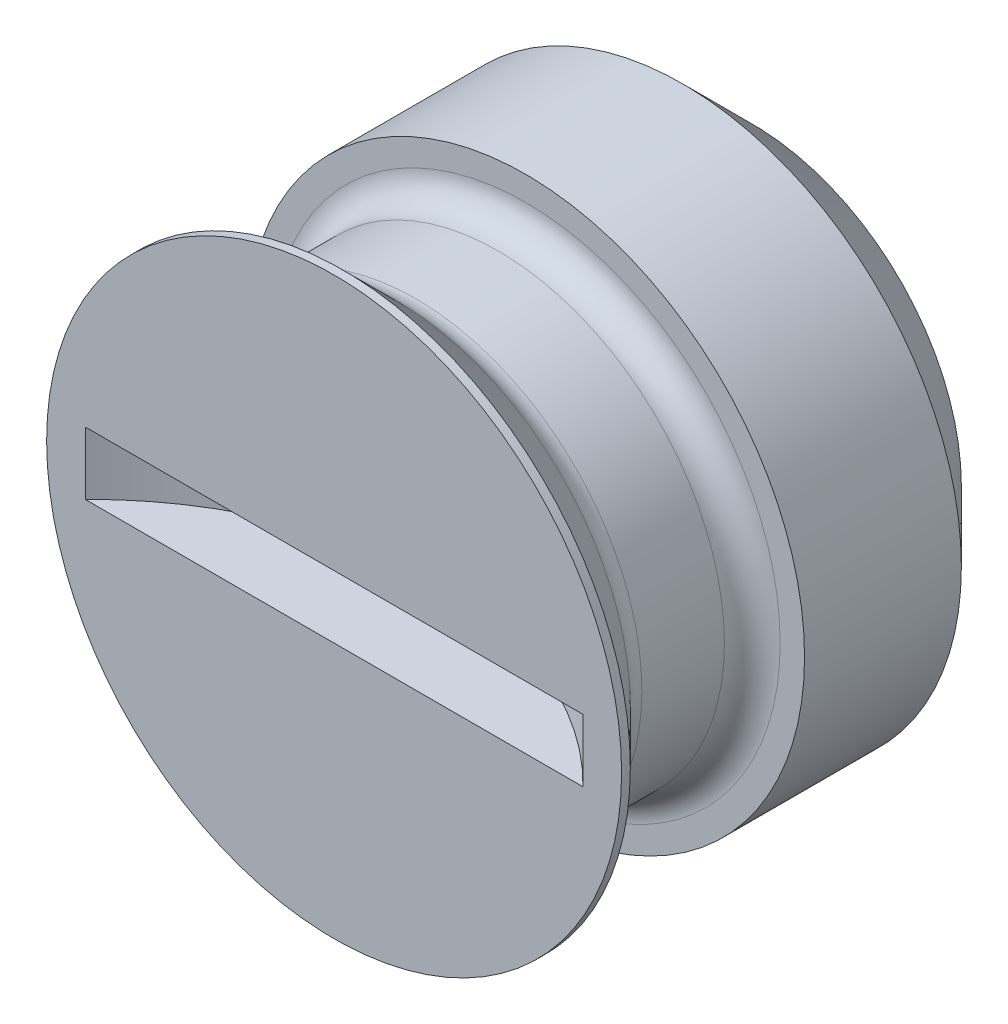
ISO-10303-21;
HEADER;
FILE_DESCRIPTION(('STEP AP214'),'2;1');
FILE_NAME('part.step','',(''),(''),'','','');
FILE_SCHEMA(('AUTOMOTIVE_DESIGN { 1 0 10303 214 1 1 1 1 }'));
ENDSEC;
DATA;
#1=APPLICATION_CONTEXT('core data for automotive mechanical design processes');
#2=APPLICATION_PROTOCOL_DEFINITION('international standard','automotive_design',2000,#1);
#3=PRODUCT_CONTEXT('',#1,'mechanical');
#4=PRODUCT('Part','Part','',(#3));
#5=PRODUCT_RELATED_PRODUCT_CATEGORY('part','',(#4));
#6=PRODUCT_DEFINITION_FORMATION('','',#4);
#7=PRODUCT_DEFINITION_CONTEXT('part definition',#1,'design');
#8=PRODUCT_DEFINITION('design','',#6,#7);
#9=PRODUCT_DEFINITION_SHAPE('','',#8);
#10=(LENGTH_UNIT() NAMED_UNIT(*) SI_UNIT(.MILLI.,.METRE.));
#11=(NAMED_UNIT(*) PLANE_ANGLE_UNIT() SI_UNIT($,.RADIAN.));
#12=(NAMED_UNIT(*) SI_UNIT($,.STERADIAN.) SOLID_ANGLE_UNIT());
#13=UNCERTAINTY_MEASURE_WITH_UNIT(LENGTH_MEASURE(1.E-05),#10,'distance_accuracy_value','');
#14=(GEOMETRIC_REPRESENTATION_CONTEXT(3) GLOBAL_UNCERTAINTY_ASSIGNED_CONTEXT((#13)) GLOBAL_UNIT_ASSIGNED_CONTEXT((#10,
#11,#12)) REPRESENTATION_CONTEXT('',''));
#15=CARTESIAN_POINT('',(0.,0.,0.));
#16=DIRECTION('',(0.,0.,1.));
#17=DIRECTION('',(1.,0.,0.));
#18=AXIS2_PLACEMENT_3D('',#15,#16,#17);
#19=CARTESIAN_POINT('',(0.,8.25,0.));
#20=DIRECTION('',(0.,0.,-1.));
#21=DIRECTION('',(-1.,0.,0.));
#22=AXIS2_PLACEMENT_3D('',#19,#20,#21);
#23=PLANE('',#22);
#24=CARTESIAN_POINT('',(0.,0.,0.));
#25=DIRECTION('',(0.,0.,1.));
#26=DIRECTION('',(1.,0.,0.));
#27=AXIS2_PLACEMENT_3D('',#24,#25,#26);
#28=CIRCLE('',#27,8.25);
#29=CARTESIAN_POINT('',(8.25,0.,0.));
#30=VERTEX_POINT('',#29);
#31=EDGE_CURVE('E76',#30,#30,#28,.T.);
#32=ORIENTED_EDGE('',*,*,#31,.T.);
#33=EDGE_LOOP('',(#32));
#34=FACE_BOUND('',#33,.T.);
#35=DIRECTION('',(1.,0.,0.));
#36=VECTOR('',#35,1.);
#37=CARTESIAN_POINT('',(0.,-0.9,0.));
#38=LINE('',#37,#36);
#39=CARTESIAN_POINT('',(-7.14142842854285,-0.9,0.));
#40=VERTEX_POINT('',#39);
#41=CARTESIAN_POINT('',(7.14142842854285,-0.9,0.));
#42=VERTEX_POINT('',#41);
#43=EDGE_CURVE('E9',#40,#42,#38,.T.);
#44=ORIENTED_EDGE('',*,*,#43,.F.);
#45=DIRECTION('',(0.,1.,0.));
#46=VECTOR('',#45,1.);
#47=CARTESIAN_POINT('',(-7.14142842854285,-0.9,0.));
#48=LINE('',#47,#46);
#49=CARTESIAN_POINT('',(-7.14142842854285,0.9,0.));
#50=VERTEX_POINT('',#49);
#51=EDGE_CURVE('E22',#40,#50,#48,.T.);
#52=ORIENTED_EDGE('',*,*,#51,.T.);
#53=DIRECTION('',(1.,0.,0.));
#54=VECTOR('',#53,1.);
#55=CARTESIAN_POINT('',(0.,0.9,0.));
#56=LINE('',#55,#54);
#57=CARTESIAN_POINT('',(7.14142842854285,0.9,0.));
#58=VERTEX_POINT('',#57);
#59=EDGE_CURVE('E40',#50,#58,#56,.T.);
#60=ORIENTED_EDGE('',*,*,#59,.T.);
#61=DIRECTION('',(0.,1.,0.));
#62=VECTOR('',#61,1.);
#63=CARTESIAN_POINT('',(7.14142842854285,-0.9,0.));
#64=LINE('',#63,#62);
#65=EDGE_CURVE('E44',#58,#42,#64,.F.);
#66=ORIENTED_EDGE('',*,*,#65,.T.);
#67=EDGE_LOOP('',(#44,#52,#60,#66));
#68=FACE_BOUND('',#67,.T.);
#69=ADVANCED_FACE('F14',(#34,#68),#23,.F.);
#70=CARTESIAN_POINT('',(0.,6.,-12.));
#71=DIRECTION('',(0.,0.,1.));
#72=DIRECTION('',(1.,0.,0.));
#73=AXIS2_PLACEMENT_3D('',#70,#71,#72);
#74=PLANE('',#73);
#75=CARTESIAN_POINT('',(0.,0.,-12.));
#76=DIRECTION('',(0.,0.,1.));
#77=DIRECTION('',(1.,0.,0.));
#78=AXIS2_PLACEMENT_3D('',#75,#76,#77);
#79=CIRCLE('',#78,6.);
#80=CARTESIAN_POINT('',(6.,0.,-12.));
#81=VERTEX_POINT('',#80);
#82=EDGE_CURVE('E45',#81,#81,#79,.T.);
#83=ORIENTED_EDGE('',*,*,#82,.F.);
#84=EDGE_LOOP('',(#83));
#85=FACE_BOUND('',#84,.T.);
#86=ADVANCED_FACE('F16',(#85),#74,.F.);
#87=CARTESIAN_POINT('',(0.,0.,-12.));
#88=DIRECTION('',(0.,0.,1.));
#89=DIRECTION('',(1.,0.,0.));
#90=AXIS2_PLACEMENT_3D('',#87,#88,#89);
#91=CONICAL_SURFACE('',#90,6.,0.785398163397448);
#92=CARTESIAN_POINT('',(0.,0.,-10.));
#93=DIRECTION('',(0.,0.,1.));
#94=DIRECTION('',(1.,0.,0.));
#95=AXIS2_PLACEMENT_3D('',#92,#93,#94);
#96=CIRCLE('',#95,8.);
#97=CARTESIAN_POINT('',(8.,0.,-10.));
#98=VERTEX_POINT('',#97);
#99=EDGE_CURVE('E55',#98,#98,#96,.T.);
#100=ORIENTED_EDGE('',*,*,#99,.F.);
#101=EDGE_LOOP('',(#100));
#102=FACE_BOUND('',#101,.T.);
#103=ORIENTED_EDGE('',*,*,#82,.T.);
#104=EDGE_LOOP('',(#103));
#105=FACE_BOUND('',#104,.T.);
#106=ADVANCED_FACE('F99',(#102,#105),#91,.T.);
#107=CARTESIAN_POINT('',(0.,0.,0.));
#108=DIRECTION('',(0.,0.,1.));
#109=DIRECTION('',(1.,0.,0.));
#110=AXIS2_PLACEMENT_3D('',#107,#108,#109);
#111=CYLINDRICAL_SURFACE('',#110,8.);
#112=CARTESIAN_POINT('',(0.,0.,-5.5));
#113=DIRECTION('',(0.,0.,1.));
#114=DIRECTION('',(1.,0.,0.));
#115=AXIS2_PLACEMENT_3D('',#112,#113,#114);
#116=CIRCLE('',#115,8.);
#117=CARTESIAN_POINT('',(8.,0.,-5.5));
#118=VERTEX_POINT('',#117);
#119=EDGE_CURVE('E58',#118,#118,#116,.T.);
#120=ORIENTED_EDGE('',*,*,#119,.F.);
#121=EDGE_LOOP('',(#120));
#122=FACE_BOUND('',#121,.T.);
#123=ORIENTED_EDGE('',*,*,#99,.T.);
#124=EDGE_LOOP('',(#123));
#125=FACE_BOUND('',#124,.T.);
#126=ADVANCED_FACE('F124',(#122,#125),#111,.T.);
#127=CARTESIAN_POINT('',(0.,8.,-5.5));
#128=DIRECTION('',(0.,0.,-1.));
#129=DIRECTION('',(-1.,0.,0.));
#130=AXIS2_PLACEMENT_3D('',#127,#128,#129);
#131=PLANE('',#130);
#132=CARTESIAN_POINT('',(0.,0.,-5.5));
#133=DIRECTION('',(0.,0.,1.));
#134=DIRECTION('',(1.,0.,0.));
#135=AXIS2_PLACEMENT_3D('',#132,#133,#134);
#136=CIRCLE('',#135,7.3);
#137=CARTESIAN_POINT('',(7.3,0.,-5.5));
#138=VERTEX_POINT('',#137);
#139=EDGE_CURVE('E61',#138,#138,#136,.T.);
#140=ORIENTED_EDGE('',*,*,#139,.F.);
#141=EDGE_LOOP('',(#140));
#142=FACE_BOUND('',#141,.T.);
#143=ORIENTED_EDGE('',*,*,#119,.T.);
#144=EDGE_LOOP('',(#143));
#145=FACE_BOUND('',#144,.T.);
#146=ADVANCED_FACE('F120',(#142,#145),#131,.F.);
#147=CARTESIAN_POINT('',(0.,0.,-4.7));
#148=DIRECTION('',(0.,0.,1.));
#149=DIRECTION('',(1.,0.,0.));
#150=AXIS2_PLACEMENT_3D('',#147,#148,#149);
#151=TOROIDAL_SURFACE('',#150,7.3,0.8);
#152=CARTESIAN_POINT('',(0.,0.,-4.7));
#153=DIRECTION('',(0.,0.,1.));
#154=DIRECTION('',(1.,0.,0.));
#155=AXIS2_PLACEMENT_3D('',#152,#153,#154);
#156=CIRCLE('',#155,6.5);
#157=CARTESIAN_POINT('',(6.5,0.,-4.7));
#158=VERTEX_POINT('',#157);
#159=EDGE_CURVE('E64',#158,#158,#156,.T.);
#160=ORIENTED_EDGE('',*,*,#159,.F.);
#161=EDGE_LOOP('',(#160));
#162=FACE_BOUND('',#161,.T.);
#163=ORIENTED_EDGE('',*,*,#139,.T.);
#164=EDGE_LOOP('',(#163));
#165=FACE_BOUND('',#164,.T.);
#166=ADVANCED_FACE('F116',(#162,#165),#151,.F.);
#167=CARTESIAN_POINT('',(0.,0.,0.));
#168=DIRECTION('',(0.,0.,1.));
#169=DIRECTION('',(1.,0.,0.));
#170=AXIS2_PLACEMENT_3D('',#167,#168,#169);
#171=CYLINDRICAL_SURFACE('',#170,6.5);
#172=CARTESIAN_POINT('',(0.,0.,-2.33137084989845));
#173=DIRECTION('',(0.,0.,1.));
#174=DIRECTION('',(1.,0.,0.));
#175=AXIS2_PLACEMENT_3D('',#172,#173,#174);
#176=CIRCLE('',#175,6.5);
#177=CARTESIAN_POINT('',(6.5,0.,-2.33137084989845));
#178=VERTEX_POINT('',#177);
#179=EDGE_CURVE('E67',#178,#178,#176,.T.);
#180=ORIENTED_EDGE('',*,*,#179,.F.);
#181=EDGE_LOOP('',(#180));
#182=FACE_BOUND('',#181,.T.);
#183=ORIENTED_EDGE('',*,*,#159,.T.);
#184=EDGE_LOOP('',(#183));
#185=FACE_BOUND('',#184,.T.);
#186=ADVANCED_FACE('F112',(#182,#185),#171,.T.);
#187=CARTESIAN_POINT('',(0.,0.,-2.33137084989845));
#188=DIRECTION('',(0.,0.,1.));
#189=DIRECTION('',(1.,0.,0.));
#190=AXIS2_PLACEMENT_3D('',#187,#188,#189);
#191=TOROIDAL_SURFACE('',#190,7.3,0.80000000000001);
#192=CARTESIAN_POINT('',(0.,0.,-1.7656854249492));
#193=DIRECTION('',(0.,0.,1.));
#194=DIRECTION('',(1.,0.,0.));
#195=AXIS2_PLACEMENT_3D('',#192,#193,#194);
#196=CIRCLE('',#195,6.73431457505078);
#197=CARTESIAN_POINT('',(6.73431457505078,0.,-1.7656854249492));
#198=VERTEX_POINT('',#197);
#199=EDGE_CURVE('E70',#198,#198,#196,.T.);
#200=ORIENTED_EDGE('',*,*,#199,.F.);
#201=EDGE_LOOP('',(#200));
#202=FACE_BOUND('',#201,.T.);
#203=ORIENTED_EDGE('',*,*,#179,.T.);
#204=EDGE_LOOP('',(#203));
#205=FACE_BOUND('',#204,.T.);
#206=ADVANCED_FACE('F108',(#202,#205),#191,.F.);
#207=CARTESIAN_POINT('',(0.,0.,-1.7656854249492));
#208=DIRECTION('',(0.,0.,1.));
#209=DIRECTION('',(1.,0.,0.));
#210=AXIS2_PLACEMENT_3D('',#207,#208,#209);
#211=CONICAL_SURFACE('',#210,6.73431457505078,0.785398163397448);
#212=CARTESIAN_POINT('',(0.,0.,-0.249999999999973));
#213=DIRECTION('',(0.,0.,1.));
#214=DIRECTION('',(1.,0.,0.));
#215=AXIS2_PLACEMENT_3D('',#212,#213,#214);
#216=CIRCLE('',#215,8.25);
#217=CARTESIAN_POINT('',(8.25,0.,-0.249999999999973));
#218=VERTEX_POINT('',#217);
#219=EDGE_CURVE('E73',#218,#218,#216,.T.);
#220=ORIENTED_EDGE('',*,*,#219,.F.);
#221=EDGE_LOOP('',(#220));
#222=FACE_BOUND('',#221,.T.);
#223=ORIENTED_EDGE('',*,*,#199,.T.);
#224=EDGE_LOOP('',(#223));
#225=FACE_BOUND('',#224,.T.);
#226=ADVANCED_FACE('F104',(#222,#225),#211,.T.);
#227=CARTESIAN_POINT('',(0.,0.,0.));
#228=DIRECTION('',(0.,0.,1.));
#229=DIRECTION('',(1.,0.,0.));
#230=AXIS2_PLACEMENT_3D('',#227,#228,#229);
#231=CYLINDRICAL_SURFACE('',#230,8.25);
#232=ORIENTED_EDGE('',*,*,#31,.F.);
#233=EDGE_LOOP('',(#232));
#234=FACE_BOUND('',#233,.T.);
#235=ORIENTED_EDGE('',*,*,#219,.T.);
#236=EDGE_LOOP('',(#235));
#237=FACE_BOUND('',#236,.T.);
#238=ADVANCED_FACE('F90',(#234,#237),#231,.T.);
#239=CARTESIAN_POINT('',(0.,-0.9,7.));
#240=DIRECTION('',(0.,1.,0.));
#241=DIRECTION('',(1.,0.,0.));
#242=AXIS2_PLACEMENT_3D('',#239,#240,#241);
#243=CYLINDRICAL_SURFACE('',#242,10.);
#244=CARTESIAN_POINT('',(0.,-0.9,7.));
#245=DIRECTION('',(0.,1.,0.));
#246=DIRECTION('',(1.,0.,0.));
#247=AXIS2_PLACEMENT_3D('',#244,#245,#246);
#248=CIRCLE('',#247,10.);
#249=EDGE_CURVE('E48',#42,#40,#248,.T.);
#250=ORIENTED_EDGE('',*,*,#249,.F.);
#251=ORIENTED_EDGE('',*,*,#65,.F.);
#252=CARTESIAN_POINT('',(0.,0.9,7.));
#253=DIRECTION('',(0.,1.,0.));
#254=DIRECTION('',(1.,0.,0.));
#255=AXIS2_PLACEMENT_3D('',#252,#253,#254);
#256=CIRCLE('',#255,10.);
#257=EDGE_CURVE('E28',#58,#50,#256,.T.);
#258=ORIENTED_EDGE('',*,*,#257,.T.);
#259=ORIENTED_EDGE('',*,*,#51,.F.);
#260=EDGE_LOOP('',(#250,#251,#258,#259));
#261=FACE_BOUND('',#260,.T.);
#262=ADVANCED_FACE('F47',(#261),#243,.F.);
#263=CARTESIAN_POINT('',(0.,-0.9,7.));
#264=DIRECTION('',(0.,1.,0.));
#265=DIRECTION('',(1.,0.,0.));
#266=AXIS2_PLACEMENT_3D('',#263,#264,#265);
#267=PLANE('',#266);
#268=ORIENTED_EDGE('',*,*,#43,.T.);
#269=ORIENTED_EDGE('',*,*,#249,.T.);
#270=EDGE_LOOP('',(#268,#269));
#271=FACE_BOUND('',#270,.T.);
#272=ADVANCED_FACE('F80',(#271),#267,.T.);
#273=CARTESIAN_POINT('',(0.,0.9,7.));
#274=DIRECTION('',(0.,1.,0.));
#275=DIRECTION('',(1.,0.,0.));
#276=AXIS2_PLACEMENT_3D('',#273,#274,#275);
#277=PLANE('',#276);
#278=ORIENTED_EDGE('',*,*,#257,.F.);
#279=ORIENTED_EDGE('',*,*,#59,.F.);
#280=EDGE_LOOP('',(#278,#279));
#281=FACE_BOUND('',#280,.T.);
#282=ADVANCED_FACE('F41',(#281),#277,.F.);
#283=CLOSED_SHELL('',(#69,#86,#106,#126,#146,#166,#186,#206,#226,#238,#262,#272,#282));
#284=MANIFOLD_SOLID_BREP('B1',#283);
#285=ADVANCED_BREP_SHAPE_REPRESENTATION('',(#18,#284),#14);
#286=SHAPE_DEFINITION_REPRESENTATION(#9,#285);
ENDSEC;
END-ISO-10303-21;
